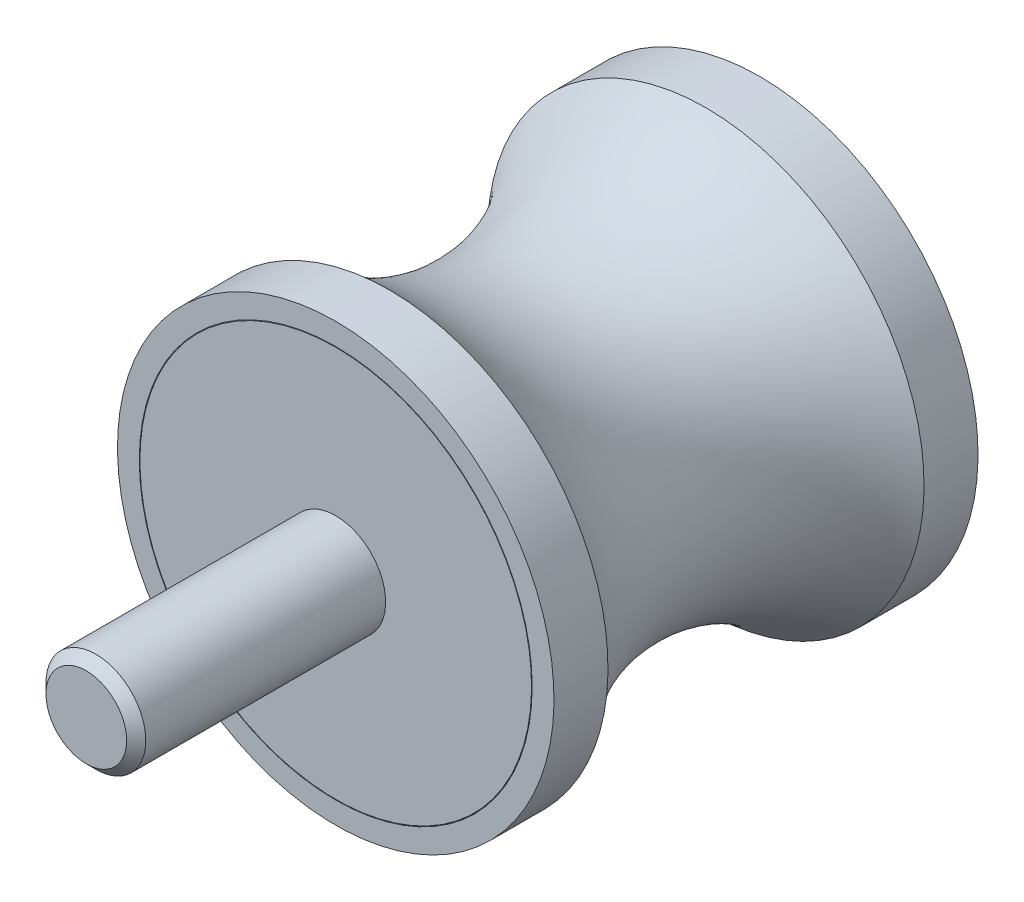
ISO-10303-21;
HEADER;
FILE_DESCRIPTION(('STEP AP214'),'2;1');
FILE_NAME('part.step','',(''),(''),'','','');
FILE_SCHEMA(('AUTOMOTIVE_DESIGN { 1 0 10303 214 1 1 1 1 }'));
ENDSEC;
DATA;
#1=APPLICATION_CONTEXT('core data for automotive mechanical design processes');
#2=APPLICATION_PROTOCOL_DEFINITION('international standard','automotive_design',2000,#1);
#3=PRODUCT_CONTEXT('',#1,'mechanical');
#4=PRODUCT('Part','Part','',(#3));
#5=PRODUCT_RELATED_PRODUCT_CATEGORY('part','',(#4));
#6=PRODUCT_DEFINITION_FORMATION('','',#4);
#7=PRODUCT_DEFINITION_CONTEXT('part definition',#1,'design');
#8=PRODUCT_DEFINITION('design','',#6,#7);
#9=PRODUCT_DEFINITION_SHAPE('','',#8);
#10=(LENGTH_UNIT() NAMED_UNIT(*) SI_UNIT(.MILLI.,.METRE.));
#11=(NAMED_UNIT(*) PLANE_ANGLE_UNIT() SI_UNIT($,.RADIAN.));
#12=(NAMED_UNIT(*) SI_UNIT($,.STERADIAN.) SOLID_ANGLE_UNIT());
#13=UNCERTAINTY_MEASURE_WITH_UNIT(LENGTH_MEASURE(1.E-05),#10,'distance_accuracy_value','');
#14=(GEOMETRIC_REPRESENTATION_CONTEXT(3) GLOBAL_UNCERTAINTY_ASSIGNED_CONTEXT((#13)) GLOBAL_UNIT_ASSIGNED_CONTEXT((#10,
#11,#12)) REPRESENTATION_CONTEXT('',''));
#15=CARTESIAN_POINT('',(0.,0.,0.));
#16=DIRECTION('',(0.,0.,1.));
#17=DIRECTION('',(1.,0.,0.));
#18=AXIS2_PLACEMENT_3D('',#15,#16,#17);
#19=CARTESIAN_POINT('',(0.,0.,0.5));
#20=DIRECTION('',(0.,0.,-1.));
#21=DIRECTION('',(0.,1.,0.));
#22=AXIS2_PLACEMENT_3D('',#19,#20,#21);
#23=CYLINDRICAL_SURFACE('',#22,15.75);
#24=CARTESIAN_POINT('',(0.,0.,0.05));
#25=DIRECTION('',(0.,0.,-1.));
#26=DIRECTION('',(0.,1.,0.));
#27=AXIS2_PLACEMENT_3D('',#24,#25,#26);
#28=CIRCLE('',#27,15.75);
#29=CARTESIAN_POINT('',(0.,15.75,0.05));
#30=VERTEX_POINT('',#29);
#31=EDGE_CURVE('E53',#30,#30,#28,.T.);
#32=ORIENTED_EDGE('',*,*,#31,.F.);
#33=EDGE_LOOP('',(#32));
#34=FACE_BOUND('',#33,.T.);
#35=CARTESIAN_POINT('',(0.,0.,0.));
#36=DIRECTION('',(0.,0.,-1.));
#37=DIRECTION('',(0.,1.,0.));
#38=AXIS2_PLACEMENT_3D('',#35,#36,#37);
#39=CIRCLE('',#38,15.75);
#40=CARTESIAN_POINT('',(0.,15.75,0.));
#41=VERTEX_POINT('',#40);
#42=EDGE_CURVE('E44',#41,#41,#39,.T.);
#43=ORIENTED_EDGE('',*,*,#42,.T.);
#44=EDGE_LOOP('',(#43));
#45=FACE_BOUND('',#44,.T.);
#46=ADVANCED_FACE('F12',(#34,#45),#23,.F.);
#47=CARTESIAN_POINT('',(0.,0.,0.5));
#48=DIRECTION('',(0.,0.,-1.));
#49=DIRECTION('',(0.,1.,0.));
#50=AXIS2_PLACEMENT_3D('',#47,#48,#49);
#51=CYLINDRICAL_SURFACE('',#50,15.75);
#52=CARTESIAN_POINT('',(0.,0.,34.));
#53=DIRECTION('',(0.,0.,-1.));
#54=DIRECTION('',(0.,1.,0.));
#55=AXIS2_PLACEMENT_3D('',#52,#53,#54);
#56=CIRCLE('',#55,15.75);
#57=CARTESIAN_POINT('',(0.,15.75,34.));
#58=VERTEX_POINT('',#57);
#59=EDGE_CURVE('E27',#58,#58,#56,.T.);
#60=ORIENTED_EDGE('',*,*,#59,.F.);
#61=EDGE_LOOP('',(#60));
#62=FACE_BOUND('',#61,.T.);
#63=CARTESIAN_POINT('',(0.,0.,33.95));
#64=DIRECTION('',(0.,0.,-1.));
#65=DIRECTION('',(0.,1.,0.));
#66=AXIS2_PLACEMENT_3D('',#63,#64,#65);
#67=CIRCLE('',#66,15.75);
#68=CARTESIAN_POINT('',(0.,15.75,33.95));
#69=VERTEX_POINT('',#68);
#70=EDGE_CURVE('E50',#69,#69,#67,.T.);
#71=ORIENTED_EDGE('',*,*,#70,.T.);
#72=EDGE_LOOP('',(#71));
#73=FACE_BOUND('',#72,.T.);
#74=ADVANCED_FACE('F89',(#62,#73),#51,.F.);
#75=CARTESIAN_POINT('',(15.75,0.,34.));
#76=DIRECTION('',(0.,0.,-1.));
#77=DIRECTION('',(0.,1.,0.));
#78=AXIS2_PLACEMENT_3D('',#75,#76,#77);
#79=PLANE('',#78);
#80=CARTESIAN_POINT('',(0.,0.,34.));
#81=DIRECTION('',(0.,0.,-1.));
#82=DIRECTION('',(0.,1.,0.));
#83=AXIS2_PLACEMENT_3D('',#80,#81,#82);
#84=CIRCLE('',#83,17.5);
#85=CARTESIAN_POINT('',(0.,17.5,34.));
#86=VERTEX_POINT('',#85);
#87=EDGE_CURVE('E32',#86,#86,#84,.T.);
#88=ORIENTED_EDGE('',*,*,#87,.F.);
#89=EDGE_LOOP('',(#88));
#90=FACE_BOUND('',#89,.T.);
#91=ORIENTED_EDGE('',*,*,#59,.T.);
#92=EDGE_LOOP('',(#91));
#93=FACE_BOUND('',#92,.T.);
#94=ADVANCED_FACE('F115',(#90,#93),#79,.F.);
#95=CARTESIAN_POINT('',(0.,0.,0.5));
#96=DIRECTION('',(0.,0.,-1.));
#97=DIRECTION('',(0.,1.,0.));
#98=AXIS2_PLACEMENT_3D('',#95,#96,#97);
#99=CYLINDRICAL_SURFACE('',#98,17.5);
#100=CARTESIAN_POINT('',(0.,0.,29.6710518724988));
#101=DIRECTION('',(0.,0.,-1.));
#102=DIRECTION('',(0.,1.,0.));
#103=AXIS2_PLACEMENT_3D('',#100,#101,#102);
#104=CIRCLE('',#103,17.5);
#105=CARTESIAN_POINT('',(0.,17.5,29.6710518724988));
#106=VERTEX_POINT('',#105);
#107=EDGE_CURVE('E35',#106,#106,#104,.T.);
#108=ORIENTED_EDGE('',*,*,#107,.F.);
#109=EDGE_LOOP('',(#108));
#110=FACE_BOUND('',#109,.T.);
#111=ORIENTED_EDGE('',*,*,#87,.T.);
#112=EDGE_LOOP('',(#111));
#113=FACE_BOUND('',#112,.T.);
#114=ADVANCED_FACE('F109',(#110,#113),#99,.T.);
#115=CARTESIAN_POINT('',(0.,0.,17.));
#116=DIRECTION('',(0.,0.,-1.));
#117=DIRECTION('',(0.,1.,0.));
#118=AXIS2_PLACEMENT_3D('',#115,#116,#117);
#119=TOROIDAL_SURFACE('',#118,31.0555555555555,18.5555555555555);
#120=CARTESIAN_POINT('',(0.,0.,4.3289481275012));
#121=DIRECTION('',(0.,0.,-1.));
#122=DIRECTION('',(0.,1.,0.));
#123=AXIS2_PLACEMENT_3D('',#120,#121,#122);
#124=CIRCLE('',#123,17.5);
#125=CARTESIAN_POINT('',(0.,17.5,4.3289481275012));
#126=VERTEX_POINT('',#125);
#127=EDGE_CURVE('E38',#126,#126,#124,.T.);
#128=ORIENTED_EDGE('',*,*,#127,.F.);
#129=EDGE_LOOP('',(#128));
#130=FACE_BOUND('',#129,.T.);
#131=ORIENTED_EDGE('',*,*,#107,.T.);
#132=EDGE_LOOP('',(#131));
#133=FACE_BOUND('',#132,.T.);
#134=ADVANCED_FACE('F103',(#130,#133),#119,.F.);
#135=CARTESIAN_POINT('',(0.,0.,0.5));
#136=DIRECTION('',(0.,0.,-1.));
#137=DIRECTION('',(0.,1.,0.));
#138=AXIS2_PLACEMENT_3D('',#135,#136,#137);
#139=CYLINDRICAL_SURFACE('',#138,17.5);
#140=CARTESIAN_POINT('',(0.,0.,0.));
#141=DIRECTION('',(0.,0.,-1.));
#142=DIRECTION('',(0.,1.,0.));
#143=AXIS2_PLACEMENT_3D('',#140,#141,#142);
#144=CIRCLE('',#143,17.5);
#145=CARTESIAN_POINT('',(0.,17.5,0.));
#146=VERTEX_POINT('',#145);
#147=EDGE_CURVE('E41',#146,#146,#144,.T.);
#148=ORIENTED_EDGE('',*,*,#147,.F.);
#149=EDGE_LOOP('',(#148));
#150=FACE_BOUND('',#149,.T.);
#151=ORIENTED_EDGE('',*,*,#127,.T.);
#152=EDGE_LOOP('',(#151));
#153=FACE_BOUND('',#152,.T.);
#154=ADVANCED_FACE('F97',(#150,#153),#139,.T.);
#155=CARTESIAN_POINT('',(17.5,0.,0.));
#156=DIRECTION('',(0.,0.,1.));
#157=DIRECTION('',(0.,-1.,0.));
#158=AXIS2_PLACEMENT_3D('',#155,#156,#157);
#159=PLANE('',#158);
#160=ORIENTED_EDGE('',*,*,#42,.F.);
#161=EDGE_LOOP('',(#160));
#162=FACE_BOUND('',#161,.T.);
#163=ORIENTED_EDGE('',*,*,#147,.T.);
#164=EDGE_LOOP('',(#163));
#165=FACE_BOUND('',#164,.T.);
#166=ADVANCED_FACE('F93',(#162,#165),#159,.F.);
#167=CARTESIAN_POINT('',(0.,0.,34.));
#168=DIRECTION('',(0.,0.,-1.));
#169=DIRECTION('',(0.,1.,0.));
#170=AXIS2_PLACEMENT_3D('',#167,#168,#169);
#171=PLANE('',#170);
#172=CARTESIAN_POINT('',(0.,0.,34.));
#173=DIRECTION('',(0.,0.,-1.));
#174=DIRECTION('',(0.,1.,0.));
#175=AXIS2_PLACEMENT_3D('',#172,#173,#174);
#176=CIRCLE('',#175,15.7);
#177=CARTESIAN_POINT('',(0.,15.7,34.));
#178=VERTEX_POINT('',#177);
#179=EDGE_CURVE('E47',#178,#178,#176,.T.);
#180=ORIENTED_EDGE('',*,*,#179,.F.);
#181=EDGE_LOOP('',(#180));
#182=FACE_BOUND('',#181,.T.);
#183=CARTESIAN_POINT('',(0.,0.,34.));
#184=DIRECTION('',(0.,0.,-1.));
#185=DIRECTION('',(0.,1.,0.));
#186=AXIS2_PLACEMENT_3D('',#183,#184,#185);
#187=CIRCLE('',#186,4.);
#188=CARTESIAN_POINT('',(0.,4.,34.));
#189=VERTEX_POINT('',#188);
#190=EDGE_CURVE('E8',#189,#189,#187,.T.);
#191=ORIENTED_EDGE('',*,*,#190,.T.);
#192=EDGE_LOOP('',(#191));
#193=FACE_BOUND('',#192,.T.);
#194=ADVANCED_FACE('F96',(#182,#193),#171,.F.);
#195=CARTESIAN_POINT('',(0.,0.,34.));
#196=DIRECTION('',(0.,0.,-1.));
#197=DIRECTION('',(0.,1.,0.));
#198=AXIS2_PLACEMENT_3D('',#195,#196,#197);
#199=CONICAL_SURFACE('',#198,15.7,0.785398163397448);
#200=ORIENTED_EDGE('',*,*,#70,.F.);
#201=EDGE_LOOP('',(#200));
#202=FACE_BOUND('',#201,.T.);
#203=ORIENTED_EDGE('',*,*,#179,.T.);
#204=EDGE_LOOP('',(#203));
#205=FACE_BOUND('',#204,.T.);
#206=ADVANCED_FACE('F129',(#202,#205),#199,.T.);
#207=CARTESIAN_POINT('',(0.,0.,54.));
#208=DIRECTION('',(0.,0.,-1.));
#209=DIRECTION('',(0.,1.,0.));
#210=AXIS2_PLACEMENT_3D('',#207,#208,#209);
#211=PLANE('',#210);
#212=CARTESIAN_POINT('',(0.,0.,54.));
#213=DIRECTION('',(0.,0.,-1.));
#214=DIRECTION('',(0.,1.,0.));
#215=AXIS2_PLACEMENT_3D('',#212,#213,#214);
#216=CIRCLE('',#215,3.233);
#217=CARTESIAN_POINT('',(0.,3.233,54.));
#218=VERTEX_POINT('',#217);
#219=EDGE_CURVE('E19',#218,#218,#216,.T.);
#220=ORIENTED_EDGE('',*,*,#219,.F.);
#221=EDGE_LOOP('',(#220));
#222=FACE_BOUND('',#221,.T.);
#223=ADVANCED_FACE('F14',(#222),#211,.F.);
#224=CARTESIAN_POINT('',(0.,0.,54.));
#225=DIRECTION('',(0.,0.,-1.));
#226=DIRECTION('',(0.,1.,0.));
#227=AXIS2_PLACEMENT_3D('',#224,#225,#226);
#228=CONICAL_SURFACE('',#227,3.233,0.785398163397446);
#229=CARTESIAN_POINT('',(0.,0.,53.233));
#230=DIRECTION('',(0.,0.,-1.));
#231=DIRECTION('',(0.,1.,0.));
#232=AXIS2_PLACEMENT_3D('',#229,#230,#231);
#233=CIRCLE('',#232,4.);
#234=CARTESIAN_POINT('',(0.,4.,53.233));
#235=VERTEX_POINT('',#234);
#236=EDGE_CURVE('E23',#235,#235,#233,.T.);
#237=ORIENTED_EDGE('',*,*,#236,.F.);
#238=EDGE_LOOP('',(#237));
#239=FACE_BOUND('',#238,.T.);
#240=ORIENTED_EDGE('',*,*,#219,.T.);
#241=EDGE_LOOP('',(#240));
#242=FACE_BOUND('',#241,.T.);
#243=ADVANCED_FACE('F142',(#239,#242),#228,.T.);
#244=CARTESIAN_POINT('',(0.,0.,0.5));
#245=DIRECTION('',(0.,0.,-1.));
#246=DIRECTION('',(0.,1.,0.));
#247=AXIS2_PLACEMENT_3D('',#244,#245,#246);
#248=CYLINDRICAL_SURFACE('',#247,4.);
#249=ORIENTED_EDGE('',*,*,#190,.F.);
#250=EDGE_LOOP('',(#249));
#251=FACE_BOUND('',#250,.T.);
#252=ORIENTED_EDGE('',*,*,#236,.T.);
#253=EDGE_LOOP('',(#252));
#254=FACE_BOUND('',#253,.T.);
#255=ADVANCED_FACE('F83',(#251,#254),#248,.T.);
#256=CARTESIAN_POINT('',(0.,0.,0.05));
#257=DIRECTION('',(0.,0.,1.));
#258=DIRECTION('',(0.,-1.,0.));
#259=AXIS2_PLACEMENT_3D('',#256,#257,#258);
#260=CONICAL_SURFACE('',#259,15.75,0.785398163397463);
#261=CARTESIAN_POINT('',(0.,0.,0.));
#262=DIRECTION('',(0.,0.,-1.));
#263=DIRECTION('',(0.,1.,0.));
#264=AXIS2_PLACEMENT_3D('',#261,#262,#263);
#265=CIRCLE('',#264,15.7);
#266=CARTESIAN_POINT('',(0.,15.7,0.));
#267=VERTEX_POINT('',#266);
#268=EDGE_CURVE('E56',#267,#267,#265,.T.);
#269=ORIENTED_EDGE('',*,*,#268,.F.);
#270=EDGE_LOOP('',(#269));
#271=FACE_BOUND('',#270,.T.);
#272=ORIENTED_EDGE('',*,*,#31,.T.);
#273=EDGE_LOOP('',(#272));
#274=FACE_BOUND('',#273,.T.);
#275=ADVANCED_FACE('F77',(#271,#274),#260,.T.);
#276=CARTESIAN_POINT('',(15.7,0.,0.));
#277=DIRECTION('',(0.,0.,1.));
#278=DIRECTION('',(0.,-1.,0.));
#279=AXIS2_PLACEMENT_3D('',#276,#277,#278);
#280=PLANE('',#279);
#281=CARTESIAN_POINT('',(0.,0.,0.));
#282=DIRECTION('',(0.,0.,-1.));
#283=DIRECTION('',(0.,1.,0.));
#284=AXIS2_PLACEMENT_3D('',#281,#282,#283);
#285=CIRCLE('',#284,4.);
#286=CARTESIAN_POINT('',(0.,4.,0.));
#287=VERTEX_POINT('',#286);
#288=EDGE_CURVE('E60',#287,#287,#285,.T.);
#289=ORIENTED_EDGE('',*,*,#288,.F.);
#290=EDGE_LOOP('',(#289));
#291=FACE_BOUND('',#290,.T.);
#292=ORIENTED_EDGE('',*,*,#268,.T.);
#293=EDGE_LOOP('',(#292));
#294=FACE_BOUND('',#293,.T.);
#295=ADVANCED_FACE('F71',(#291,#294),#280,.F.);
#296=CARTESIAN_POINT('',(0.,0.,8.));
#297=DIRECTION('',(0.,0.,-1.));
#298=DIRECTION('',(0.,1.,0.));
#299=AXIS2_PLACEMENT_3D('',#296,#297,#298);
#300=CYLINDRICAL_SURFACE('',#299,4.);
#301=CARTESIAN_POINT('',(0.,0.,8.));
#302=DIRECTION('',(0.,0.,-1.));
#303=DIRECTION('',(0.,1.,0.));
#304=AXIS2_PLACEMENT_3D('',#301,#302,#303);
#305=CIRCLE('',#304,4.);
#306=CARTESIAN_POINT('',(0.,4.,8.));
#307=VERTEX_POINT('',#306);
#308=EDGE_CURVE('E59',#307,#307,#305,.T.);
#309=ORIENTED_EDGE('',*,*,#308,.F.);
#310=EDGE_LOOP('',(#309));
#311=FACE_BOUND('',#310,.T.);
#312=ORIENTED_EDGE('',*,*,#288,.T.);
#313=EDGE_LOOP('',(#312));
#314=FACE_BOUND('',#313,.T.);
#315=ADVANCED_FACE('F68',(#311,#314),#300,.F.);
#316=CARTESIAN_POINT('',(0.,0.,8.));
#317=DIRECTION('',(0.,0.,-1.));
#318=DIRECTION('',(0.,1.,0.));
#319=AXIS2_PLACEMENT_3D('',#316,#317,#318);
#320=PLANE('',#319);
#321=ORIENTED_EDGE('',*,*,#308,.T.);
#322=EDGE_LOOP('',(#321));
#323=FACE_BOUND('',#322,.T.);
#324=ADVANCED_FACE('F66',(#323),#320,.T.);
#325=CLOSED_SHELL('',(#46,#74,#94,#114,#134,#154,#166,#194,#206,#223,#243,#255,#275,#295,#315,#324));
#326=MANIFOLD_SOLID_BREP('B1',#325);
#327=ADVANCED_BREP_SHAPE_REPRESENTATION('',(#18,#326),#14);
#328=SHAPE_DEFINITION_REPRESENTATION(#9,#327);
ENDSEC;
END-ISO-10303-21;
